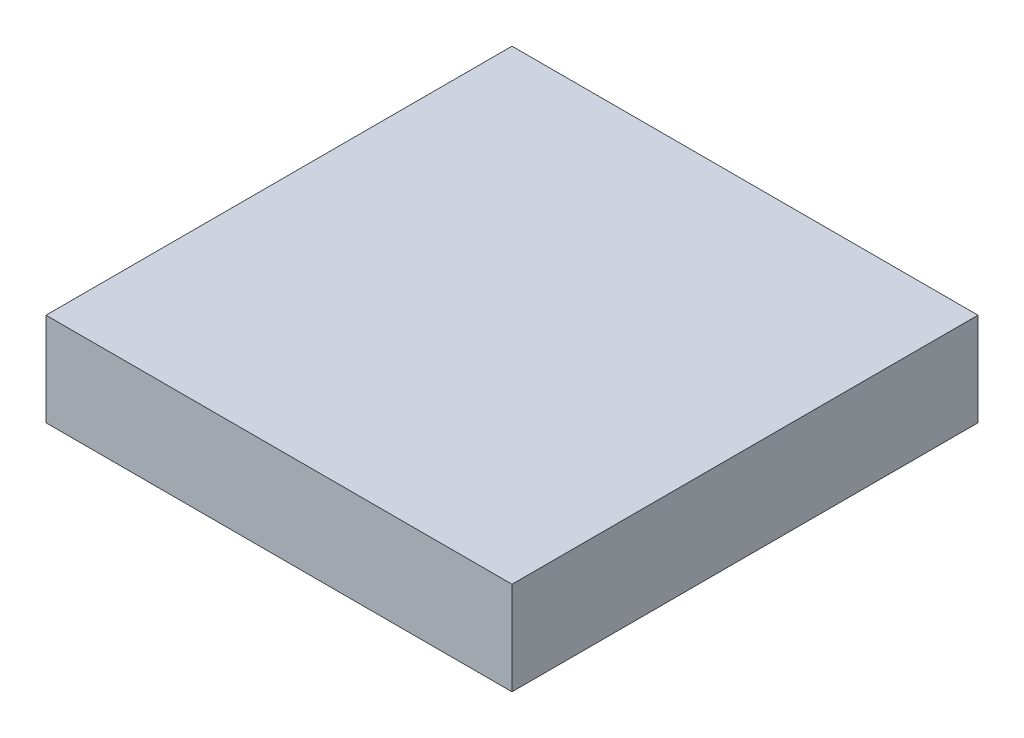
ISO-10303-21;
HEADER;
FILE_DESCRIPTION(('STEP AP214'),'2;1');
FILE_NAME('part.step','',(''),(''),'','','');
FILE_SCHEMA(('AUTOMOTIVE_DESIGN { 1 0 10303 214 1 1 1 1 }'));
ENDSEC;
DATA;
#1=APPLICATION_CONTEXT('core data for automotive mechanical design processes');
#2=APPLICATION_PROTOCOL_DEFINITION('international standard','automotive_design',2000,#1);
#3=PRODUCT_CONTEXT('',#1,'mechanical');
#4=PRODUCT('Part','Part','',(#3));
#5=PRODUCT_RELATED_PRODUCT_CATEGORY('part','',(#4));
#6=PRODUCT_DEFINITION_FORMATION('','',#4);
#7=PRODUCT_DEFINITION_CONTEXT('part definition',#1,'design');
#8=PRODUCT_DEFINITION('design','',#6,#7);
#9=PRODUCT_DEFINITION_SHAPE('','',#8);
#10=(LENGTH_UNIT() NAMED_UNIT(*) SI_UNIT(.MILLI.,.METRE.));
#11=(NAMED_UNIT(*) PLANE_ANGLE_UNIT() SI_UNIT($,.RADIAN.));
#12=(NAMED_UNIT(*) SI_UNIT($,.STERADIAN.) SOLID_ANGLE_UNIT());
#13=UNCERTAINTY_MEASURE_WITH_UNIT(LENGTH_MEASURE(1.E-05),#10,'distance_accuracy_value','');
#14=(GEOMETRIC_REPRESENTATION_CONTEXT(3) GLOBAL_UNCERTAINTY_ASSIGNED_CONTEXT((#13)) GLOBAL_UNIT_ASSIGNED_CONTEXT((#10,
#11,#12)) REPRESENTATION_CONTEXT('',''));
#15=CARTESIAN_POINT('',(0.,0.,0.));
#16=DIRECTION('',(0.,0.,1.));
#17=DIRECTION('',(1.,0.,0.));
#18=AXIS2_PLACEMENT_3D('',#15,#16,#17);
#19=CARTESIAN_POINT('',(0.,0.,0.));
#20=DIRECTION('',(0.,1.,0.));
#21=DIRECTION('',(0.,0.,1.));
#22=AXIS2_PLACEMENT_3D('',#19,#20,#21);
#23=PLANE('',#22);
#24=DIRECTION('',(-1.,0.,0.));
#25=VECTOR('',#24,1.);
#26=CARTESIAN_POINT('',(-6.5,0.,6.5));
#27=LINE('',#26,#25);
#28=CARTESIAN_POINT('',(6.5,0.,6.5));
#29=VERTEX_POINT('',#28);
#30=CARTESIAN_POINT('',(-6.5,0.,6.5));
#31=VERTEX_POINT('',#30);
#32=EDGE_CURVE('E81',#29,#31,#27,.T.);
#33=ORIENTED_EDGE('',*,*,#32,.T.);
#34=DIRECTION('',(0.,0.,-1.));
#35=VECTOR('',#34,1.);
#36=CARTESIAN_POINT('',(-6.5,0.,-6.5));
#37=LINE('',#36,#35);
#38=CARTESIAN_POINT('',(-6.5,0.,-6.5));
#39=VERTEX_POINT('',#38);
#40=EDGE_CURVE('E68',#31,#39,#37,.T.);
#41=ORIENTED_EDGE('',*,*,#40,.T.);
#42=DIRECTION('',(1.,0.,0.));
#43=VECTOR('',#42,1.);
#44=CARTESIAN_POINT('',(-6.5,0.,-6.5));
#45=LINE('',#44,#43);
#46=CARTESIAN_POINT('',(6.5,0.,-6.5));
#47=VERTEX_POINT('',#46);
#48=EDGE_CURVE('E55',#39,#47,#45,.T.);
#49=ORIENTED_EDGE('',*,*,#48,.T.);
#50=DIRECTION('',(0.,0.,1.));
#51=VECTOR('',#50,1.);
#52=CARTESIAN_POINT('',(6.5,0.,-6.5));
#53=LINE('',#52,#51);
#54=EDGE_CURVE('E20',#47,#29,#53,.T.);
#55=ORIENTED_EDGE('',*,*,#54,.T.);
#56=EDGE_LOOP('',(#33,#41,#49,#55));
#57=FACE_BOUND('',#56,.T.);
#58=ADVANCED_FACE('F17',(#57),#23,.F.);
#59=CARTESIAN_POINT('',(6.5,2.6,-6.5));
#60=DIRECTION('',(-1.,0.,0.));
#61=DIRECTION('',(0.,0.,1.));
#62=AXIS2_PLACEMENT_3D('',#59,#60,#61);
#63=PLANE('',#62);
#64=DIRECTION('',(0.,1.,0.));
#65=VECTOR('',#64,1.);
#66=CARTESIAN_POINT('',(6.5,2.6,-6.5));
#67=LINE('',#66,#65);
#68=CARTESIAN_POINT('',(6.5,2.6,-6.5));
#69=VERTEX_POINT('',#68);
#70=EDGE_CURVE('E61',#47,#69,#67,.T.);
#71=ORIENTED_EDGE('',*,*,#70,.T.);
#72=DIRECTION('',(0.,0.,1.));
#73=VECTOR('',#72,1.);
#74=CARTESIAN_POINT('',(6.5,2.6,0.));
#75=LINE('',#74,#73);
#76=CARTESIAN_POINT('',(6.5,2.6,6.5));
#77=VERTEX_POINT('',#76);
#78=EDGE_CURVE('E83',#77,#69,#75,.F.);
#79=ORIENTED_EDGE('',*,*,#78,.F.);
#80=DIRECTION('',(0.,1.,0.));
#81=VECTOR('',#80,1.);
#82=CARTESIAN_POINT('',(6.5,2.6,6.5));
#83=LINE('',#82,#81);
#84=EDGE_CURVE('E64',#77,#29,#83,.F.);
#85=ORIENTED_EDGE('',*,*,#84,.T.);
#86=ORIENTED_EDGE('',*,*,#54,.F.);
#87=EDGE_LOOP('',(#71,#79,#85,#86));
#88=FACE_BOUND('',#87,.T.);
#89=ADVANCED_FACE('F60',(#88),#63,.F.);
#90=CARTESIAN_POINT('',(-6.5,2.6,-6.5));
#91=DIRECTION('',(0.,0.,1.));
#92=DIRECTION('',(1.,0.,0.));
#93=AXIS2_PLACEMENT_3D('',#90,#91,#92);
#94=PLANE('',#93);
#95=DIRECTION('',(0.,1.,0.));
#96=VECTOR('',#95,1.);
#97=CARTESIAN_POINT('',(-6.5,2.6,-6.5));
#98=LINE('',#97,#96);
#99=CARTESIAN_POINT('',(-6.5,2.6,-6.5));
#100=VERTEX_POINT('',#99);
#101=EDGE_CURVE('E70',#39,#100,#98,.T.);
#102=ORIENTED_EDGE('',*,*,#101,.T.);
#103=DIRECTION('',(1.,0.,0.));
#104=VECTOR('',#103,1.);
#105=CARTESIAN_POINT('',(0.,2.6,-6.5));
#106=LINE('',#105,#104);
#107=EDGE_CURVE('E74',#69,#100,#106,.F.);
#108=ORIENTED_EDGE('',*,*,#107,.F.);
#109=ORIENTED_EDGE('',*,*,#70,.F.);
#110=ORIENTED_EDGE('',*,*,#48,.F.);
#111=EDGE_LOOP('',(#102,#108,#109,#110));
#112=FACE_BOUND('',#111,.T.);
#113=ADVANCED_FACE('F72',(#112),#94,.F.);
#114=CARTESIAN_POINT('',(-6.5,2.6,-6.5));
#115=DIRECTION('',(1.,0.,0.));
#116=DIRECTION('',(0.,0.,-1.));
#117=AXIS2_PLACEMENT_3D('',#114,#115,#116);
#118=PLANE('',#117);
#119=DIRECTION('',(0.,1.,0.));
#120=VECTOR('',#119,1.);
#121=CARTESIAN_POINT('',(-6.5,2.6,6.5));
#122=LINE('',#121,#120);
#123=CARTESIAN_POINT('',(-6.5,2.6,6.5));
#124=VERTEX_POINT('',#123);
#125=EDGE_CURVE('E35',#31,#124,#122,.T.);
#126=ORIENTED_EDGE('',*,*,#125,.T.);
#127=DIRECTION('',(0.,0.,1.));
#128=VECTOR('',#127,1.);
#129=CARTESIAN_POINT('',(-6.5,2.6,0.));
#130=LINE('',#129,#128);
#131=EDGE_CURVE('E26',#100,#124,#130,.T.);
#132=ORIENTED_EDGE('',*,*,#131,.F.);
#133=ORIENTED_EDGE('',*,*,#101,.F.);
#134=ORIENTED_EDGE('',*,*,#40,.F.);
#135=EDGE_LOOP('',(#126,#132,#133,#134));
#136=FACE_BOUND('',#135,.T.);
#137=ADVANCED_FACE('F89',(#136),#118,.F.);
#138=CARTESIAN_POINT('',(-6.5,2.6,6.5));
#139=DIRECTION('',(0.,0.,-1.));
#140=DIRECTION('',(-1.,0.,0.));
#141=AXIS2_PLACEMENT_3D('',#138,#139,#140);
#142=PLANE('',#141);
#143=ORIENTED_EDGE('',*,*,#84,.F.);
#144=DIRECTION('',(1.,0.,0.));
#145=VECTOR('',#144,1.);
#146=CARTESIAN_POINT('',(0.,2.6,6.5));
#147=LINE('',#146,#145);
#148=EDGE_CURVE('E11',#124,#77,#147,.T.);
#149=ORIENTED_EDGE('',*,*,#148,.F.);
#150=ORIENTED_EDGE('',*,*,#125,.F.);
#151=ORIENTED_EDGE('',*,*,#32,.F.);
#152=EDGE_LOOP('',(#143,#149,#150,#151));
#153=FACE_BOUND('',#152,.T.);
#154=ADVANCED_FACE('F91',(#153),#142,.F.);
#155=CARTESIAN_POINT('',(0.,2.6,0.));
#156=DIRECTION('',(0.,1.,0.));
#157=DIRECTION('',(0.,0.,1.));
#158=AXIS2_PLACEMENT_3D('',#155,#156,#157);
#159=PLANE('',#158);
#160=ORIENTED_EDGE('',*,*,#131,.T.);
#161=ORIENTED_EDGE('',*,*,#148,.T.);
#162=ORIENTED_EDGE('',*,*,#78,.T.);
#163=ORIENTED_EDGE('',*,*,#107,.T.);
#164=EDGE_LOOP('',(#160,#161,#162,#163));
#165=FACE_BOUND('',#164,.T.);
#166=ADVANCED_FACE('F88',(#165),#159,.T.);
#167=CLOSED_SHELL('',(#58,#89,#113,#137,#154,#166));
#168=MANIFOLD_SOLID_BREP('B1',#167);
#169=ADVANCED_BREP_SHAPE_REPRESENTATION('',(#18,#168),#14);
#170=SHAPE_DEFINITION_REPRESENTATION(#9,#169);
ENDSEC;
END-ISO-10303-21;
